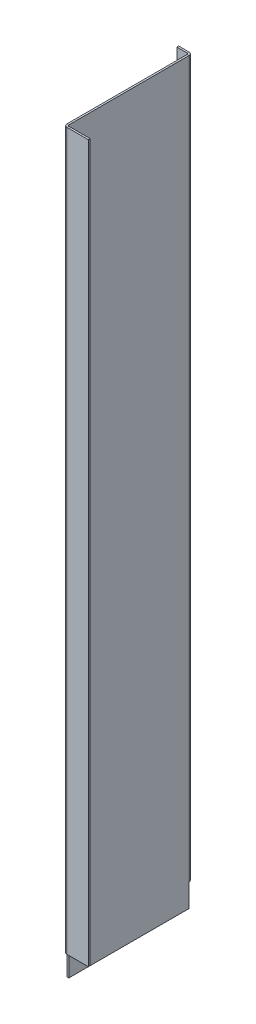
ISO-10303-21;
HEADER;
FILE_DESCRIPTION(('STEP AP214'),'2;1');
FILE_NAME('part.step','',(''),(''),'','','');
FILE_SCHEMA(('AUTOMOTIVE_DESIGN { 1 0 10303 214 1 1 1 1 }'));
ENDSEC;
DATA;
#1=APPLICATION_CONTEXT('core data for automotive mechanical design processes');
#2=APPLICATION_PROTOCOL_DEFINITION('international standard','automotive_design',2000,#1);
#3=PRODUCT_CONTEXT('',#1,'mechanical');
#4=PRODUCT('Part','Part','',(#3));
#5=PRODUCT_RELATED_PRODUCT_CATEGORY('part','',(#4));
#6=PRODUCT_DEFINITION_FORMATION('','',#4);
#7=PRODUCT_DEFINITION_CONTEXT('part definition',#1,'design');
#8=PRODUCT_DEFINITION('design','',#6,#7);
#9=PRODUCT_DEFINITION_SHAPE('','',#8);
#10=(LENGTH_UNIT() NAMED_UNIT(*) SI_UNIT(.MILLI.,.METRE.));
#11=(NAMED_UNIT(*) PLANE_ANGLE_UNIT() SI_UNIT($,.RADIAN.));
#12=(NAMED_UNIT(*) SI_UNIT($,.STERADIAN.) SOLID_ANGLE_UNIT());
#13=UNCERTAINTY_MEASURE_WITH_UNIT(LENGTH_MEASURE(1.E-05),#10,'distance_accuracy_value','');
#14=(GEOMETRIC_REPRESENTATION_CONTEXT(3) GLOBAL_UNCERTAINTY_ASSIGNED_CONTEXT((#13)) GLOBAL_UNIT_ASSIGNED_CONTEXT((#10,
#11,#12)) REPRESENTATION_CONTEXT('',''));
#15=CARTESIAN_POINT('',(0.,0.,0.));
#16=DIRECTION('',(0.,0.,1.));
#17=DIRECTION('',(1.,0.,0.));
#18=AXIS2_PLACEMENT_3D('',#15,#16,#17);
#19=CARTESIAN_POINT('',(-439.4,-313.8,1.5));
#20=DIRECTION('',(0.,1.,0.));
#21=DIRECTION('',(0.,0.,1.));
#22=AXIS2_PLACEMENT_3D('',#19,#20,#21);
#23=PLANE('',#22);
#24=DIRECTION('',(0.,0.,-1.));
#25=VECTOR('',#24,1.);
#26=CARTESIAN_POINT('',(-430.9,-313.8,1.5));
#27=LINE('',#26,#25);
#28=CARTESIAN_POINT('',(-430.9,-313.8,1.5));
#29=VERTEX_POINT('',#28);
#30=CARTESIAN_POINT('',(-430.9,-313.8,0.));
#31=VERTEX_POINT('',#30);
#32=EDGE_CURVE('E290',#29,#31,#27,.T.);
#33=ORIENTED_EDGE('',*,*,#32,.F.);
#34=DIRECTION('',(1.,0.,0.));
#35=VECTOR('',#34,1.);
#36=CARTESIAN_POINT('',(-439.4,-313.8,1.5));
#37=LINE('',#36,#35);
#38=CARTESIAN_POINT('',(-439.4,-313.8,1.5));
#39=VERTEX_POINT('',#38);
#40=EDGE_CURVE('E301',#39,#29,#37,.T.);
#41=ORIENTED_EDGE('',*,*,#40,.F.);
#42=DIRECTION('',(0.,0.,-1.));
#43=VECTOR('',#42,1.);
#44=CARTESIAN_POINT('',(-439.4,-313.8,1.5));
#45=LINE('',#44,#43);
#46=CARTESIAN_POINT('',(-439.4,-313.8,0.));
#47=VERTEX_POINT('',#46);
#48=EDGE_CURVE('E13',#39,#47,#45,.T.);
#49=ORIENTED_EDGE('',*,*,#48,.T.);
#50=DIRECTION('',(1.,0.,0.));
#51=VECTOR('',#50,1.);
#52=CARTESIAN_POINT('',(-439.4,-313.8,0.));
#53=LINE('',#52,#51);
#54=EDGE_CURVE('E309',#47,#31,#53,.T.);
#55=ORIENTED_EDGE('',*,*,#54,.T.);
#56=EDGE_LOOP('',(#33,#41,#49,#55));
#57=FACE_BOUND('',#56,.T.);
#58=ADVANCED_FACE('F78',(#57),#23,.F.);
#59=CARTESIAN_POINT('',(-439.4,272.7,1.5));
#60=DIRECTION('',(0.,-1.,0.));
#61=DIRECTION('',(1.,0.,0.));
#62=AXIS2_PLACEMENT_3D('',#59,#60,#61);
#63=PLANE('',#62);
#64=DIRECTION('',(0.,0.,-1.));
#65=VECTOR('',#64,1.);
#66=CARTESIAN_POINT('',(-430.9,272.7,1.5));
#67=LINE('',#66,#65);
#68=CARTESIAN_POINT('',(-430.9,272.7,1.5));
#69=VERTEX_POINT('',#68);
#70=CARTESIAN_POINT('',(-430.9,272.7,0.));
#71=VERTEX_POINT('',#70);
#72=EDGE_CURVE('E278',#69,#71,#67,.T.);
#73=ORIENTED_EDGE('',*,*,#72,.T.);
#74=DIRECTION('',(-1.,0.,0.));
#75=VECTOR('',#74,1.);
#76=CARTESIAN_POINT('',(-439.4,272.7,0.));
#77=LINE('',#76,#75);
#78=CARTESIAN_POINT('',(-439.4,272.7,0.));
#79=VERTEX_POINT('',#78);
#80=EDGE_CURVE('E302',#71,#79,#77,.T.);
#81=ORIENTED_EDGE('',*,*,#80,.T.);
#82=DIRECTION('',(0.,0.,-1.));
#83=VECTOR('',#82,1.);
#84=CARTESIAN_POINT('',(-439.4,272.7,1.5));
#85=LINE('',#84,#83);
#86=CARTESIAN_POINT('',(-439.4,272.7,1.5));
#87=VERTEX_POINT('',#86);
#88=EDGE_CURVE('E86',#87,#79,#85,.T.);
#89=ORIENTED_EDGE('',*,*,#88,.F.);
#90=DIRECTION('',(-1.,0.,0.));
#91=VECTOR('',#90,1.);
#92=CARTESIAN_POINT('',(-439.4,272.7,1.5));
#93=LINE('',#92,#91);
#94=EDGE_CURVE('E305',#69,#87,#93,.T.);
#95=ORIENTED_EDGE('',*,*,#94,.F.);
#96=EDGE_LOOP('',(#73,#81,#89,#95));
#97=FACE_BOUND('',#96,.T.);
#98=ADVANCED_FACE('F328',(#97),#63,.F.);
#99=CARTESIAN_POINT('',(0.,0.,1.5));
#100=DIRECTION('',(0.,0.,-1.));
#101=DIRECTION('',(-1.,0.,0.));
#102=AXIS2_PLACEMENT_3D('',#99,#100,#101);
#103=PLANE('',#102);
#104=CARTESIAN_POINT('',(-435.15,-303.8,1.5));
#105=DIRECTION('',(0.,0.,1.));
#106=DIRECTION('',(1.,0.,0.));
#107=AXIS2_PLACEMENT_3D('',#104,#105,#106);
#108=CIRCLE('',#107,1.50000000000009);
#109=CARTESIAN_POINT('',(-433.65,-303.8,1.5));
#110=VERTEX_POINT('',#109);
#111=EDGE_CURVE('E377',#110,#110,#108,.T.);
#112=ORIENTED_EDGE('',*,*,#111,.F.);
#113=EDGE_LOOP('',(#112));
#114=FACE_BOUND('',#113,.T.);
#115=CARTESIAN_POINT('',(-435.15,262.7,1.5));
#116=DIRECTION('',(0.,0.,1.));
#117=DIRECTION('',(1.,0.,0.));
#118=AXIS2_PLACEMENT_3D('',#115,#116,#117);
#119=CIRCLE('',#118,1.49999999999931);
#120=CARTESIAN_POINT('',(-433.650000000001,262.7,1.5));
#121=VERTEX_POINT('',#120);
#122=EDGE_CURVE('E371',#121,#121,#119,.T.);
#123=ORIENTED_EDGE('',*,*,#122,.F.);
#124=EDGE_LOOP('',(#123));
#125=FACE_BOUND('',#124,.T.);
#126=DIRECTION('',(0.,1.,0.));
#127=VECTOR('',#126,1.);
#128=CARTESIAN_POINT('',(-430.9,272.7,1.5));
#129=LINE('',#128,#127);
#130=EDGE_CURVE('E284',#69,#29,#129,.F.);
#131=ORIENTED_EDGE('',*,*,#130,.F.);
#132=ORIENTED_EDGE('',*,*,#94,.T.);
#133=DIRECTION('',(0.,-1.,0.));
#134=VECTOR('',#133,1.);
#135=CARTESIAN_POINT('',(-439.4,-313.8,1.5));
#136=LINE('',#135,#134);
#137=EDGE_CURVE('E298',#87,#39,#136,.T.);
#138=ORIENTED_EDGE('',*,*,#137,.T.);
#139=ORIENTED_EDGE('',*,*,#40,.T.);
#140=EDGE_LOOP('',(#131,#132,#138,#139));
#141=FACE_BOUND('',#140,.T.);
#142=ADVANCED_FACE('F327',(#114,#125,#141),#103,.F.);
#143=CARTESIAN_POINT('',(0.,0.,0.));
#144=DIRECTION('',(0.,0.,-1.));
#145=DIRECTION('',(-1.,0.,0.));
#146=AXIS2_PLACEMENT_3D('',#143,#144,#145);
#147=PLANE('',#146);
#148=CARTESIAN_POINT('',(-435.15,-303.8,0.));
#149=DIRECTION('',(0.,0.,1.));
#150=DIRECTION('',(1.,0.,0.));
#151=AXIS2_PLACEMENT_3D('',#148,#149,#150);
#152=CIRCLE('',#151,1.50000000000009);
#153=CARTESIAN_POINT('',(-433.65,-303.8,0.));
#154=VERTEX_POINT('',#153);
#155=EDGE_CURVE('E231',#154,#154,#152,.T.);
#156=ORIENTED_EDGE('',*,*,#155,.T.);
#157=EDGE_LOOP('',(#156));
#158=FACE_BOUND('',#157,.T.);
#159=CARTESIAN_POINT('',(-435.15,262.7,0.));
#160=DIRECTION('',(0.,0.,1.));
#161=DIRECTION('',(1.,0.,0.));
#162=AXIS2_PLACEMENT_3D('',#159,#160,#161);
#163=CIRCLE('',#162,1.49999999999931);
#164=CARTESIAN_POINT('',(-433.650000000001,262.7,0.));
#165=VERTEX_POINT('',#164);
#166=EDGE_CURVE('E374',#165,#165,#163,.T.);
#167=ORIENTED_EDGE('',*,*,#166,.T.);
#168=EDGE_LOOP('',(#167));
#169=FACE_BOUND('',#168,.T.);
#170=ORIENTED_EDGE('',*,*,#80,.F.);
#171=DIRECTION('',(0.,1.,0.));
#172=VECTOR('',#171,1.);
#173=CARTESIAN_POINT('',(-430.9,272.7,0.));
#174=LINE('',#173,#172);
#175=EDGE_CURVE('E273',#71,#31,#174,.F.);
#176=ORIENTED_EDGE('',*,*,#175,.T.);
#177=ORIENTED_EDGE('',*,*,#54,.F.);
#178=DIRECTION('',(0.,-1.,0.));
#179=VECTOR('',#178,1.);
#180=CARTESIAN_POINT('',(-439.4,-313.8,0.));
#181=LINE('',#180,#179);
#182=EDGE_CURVE('E295',#79,#47,#181,.T.);
#183=ORIENTED_EDGE('',*,*,#182,.F.);
#184=EDGE_LOOP('',(#170,#176,#177,#183));
#185=FACE_BOUND('',#184,.T.);
#186=ADVANCED_FACE('F322',(#158,#169,#185),#147,.T.);
#187=CARTESIAN_POINT('',(-439.4,-313.8,1.5));
#188=DIRECTION('',(1.,0.,0.));
#189=DIRECTION('',(0.,0.,-1.));
#190=AXIS2_PLACEMENT_3D('',#187,#188,#189);
#191=PLANE('',#190);
#192=ORIENTED_EDGE('',*,*,#182,.T.);
#193=ORIENTED_EDGE('',*,*,#48,.F.);
#194=ORIENTED_EDGE('',*,*,#137,.F.);
#195=ORIENTED_EDGE('',*,*,#88,.T.);
#196=EDGE_LOOP('',(#192,#193,#194,#195));
#197=FACE_BOUND('',#196,.T.);
#198=ADVANCED_FACE('F80',(#197),#191,.F.);
#199=CARTESIAN_POINT('',(-430.9,-313.8,2.50000000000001));
#200=DIRECTION('',(0.,-1.,0.));
#201=DIRECTION('',(0.,0.,-1.));
#202=AXIS2_PLACEMENT_3D('',#199,#200,#201);
#203=PLANE('',#202);
#204=DIRECTION('',(1.,0.,0.));
#205=VECTOR('',#204,1.);
#206=CARTESIAN_POINT('',(-429.9,-313.8,2.5));
#207=LINE('',#206,#205);
#208=CARTESIAN_POINT('',(-429.9,-313.8,2.5));
#209=VERTEX_POINT('',#208);
#210=CARTESIAN_POINT('',(-428.4,-313.8,2.5));
#211=VERTEX_POINT('',#210);
#212=EDGE_CURVE('E292',#209,#211,#207,.T.);
#213=ORIENTED_EDGE('',*,*,#212,.F.);
#214=CARTESIAN_POINT('',(-430.9,-313.8,2.50000000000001));
#215=DIRECTION('',(0.,1.,0.));
#216=DIRECTION('',(0.,0.,1.));
#217=AXIS2_PLACEMENT_3D('',#214,#215,#216);
#218=CIRCLE('',#217,1.);
#219=EDGE_CURVE('E281',#29,#209,#218,.F.);
#220=ORIENTED_EDGE('',*,*,#219,.F.);
#221=ORIENTED_EDGE('',*,*,#32,.T.);
#222=CARTESIAN_POINT('',(-430.9,-313.8,2.50000000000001));
#223=DIRECTION('',(0.,1.,0.));
#224=DIRECTION('',(0.,0.,1.));
#225=AXIS2_PLACEMENT_3D('',#222,#223,#224);
#226=CIRCLE('',#225,2.5);
#227=EDGE_CURVE('E101',#31,#211,#226,.F.);
#228=ORIENTED_EDGE('',*,*,#227,.T.);
#229=EDGE_LOOP('',(#213,#220,#221,#228));
#230=FACE_BOUND('',#229,.T.);
#231=ADVANCED_FACE('F417',(#230),#203,.T.);
#232=CARTESIAN_POINT('',(-430.9,272.7,2.50000000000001));
#233=DIRECTION('',(0.,-1.,0.));
#234=DIRECTION('',(0.,0.,-1.));
#235=AXIS2_PLACEMENT_3D('',#232,#233,#234);
#236=PLANE('',#235);
#237=CARTESIAN_POINT('',(-430.9,272.7,2.50000000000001));
#238=DIRECTION('',(0.,1.,0.));
#239=DIRECTION('',(0.,0.,1.));
#240=AXIS2_PLACEMENT_3D('',#237,#238,#239);
#241=CIRCLE('',#240,1.);
#242=CARTESIAN_POINT('',(-429.9,272.7,2.5));
#243=VERTEX_POINT('',#242);
#244=EDGE_CURVE('E286',#243,#69,#241,.T.);
#245=ORIENTED_EDGE('',*,*,#244,.F.);
#246=DIRECTION('',(-1.,0.,0.));
#247=VECTOR('',#246,1.);
#248=CARTESIAN_POINT('',(-429.9,272.7,2.5));
#249=LINE('',#248,#247);
#250=CARTESIAN_POINT('',(-428.4,272.7,2.5));
#251=VERTEX_POINT('',#250);
#252=EDGE_CURVE('E266',#243,#251,#249,.F.);
#253=ORIENTED_EDGE('',*,*,#252,.T.);
#254=CARTESIAN_POINT('',(-430.9,272.7,2.50000000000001));
#255=DIRECTION('',(0.,1.,0.));
#256=DIRECTION('',(0.,0.,1.));
#257=AXIS2_PLACEMENT_3D('',#254,#255,#256);
#258=CIRCLE('',#257,2.5);
#259=EDGE_CURVE('E276',#251,#71,#258,.T.);
#260=ORIENTED_EDGE('',*,*,#259,.T.);
#261=ORIENTED_EDGE('',*,*,#72,.F.);
#262=EDGE_LOOP('',(#245,#253,#260,#261));
#263=FACE_BOUND('',#262,.T.);
#264=ADVANCED_FACE('F331',(#263),#236,.F.);
#265=CARTESIAN_POINT('',(-430.9,272.7,2.50000000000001));
#266=DIRECTION('',(0.,1.,0.));
#267=DIRECTION('',(1.,0.,0.));
#268=AXIS2_PLACEMENT_3D('',#265,#266,#267);
#269=CYLINDRICAL_SURFACE('',#268,2.5);
#270=ORIENTED_EDGE('',*,*,#175,.F.);
#271=ORIENTED_EDGE('',*,*,#259,.F.);
#272=DIRECTION('',(0.,1.,0.));
#273=VECTOR('',#272,1.);
#274=CARTESIAN_POINT('',(-428.4,-332.8,2.5));
#275=LINE('',#274,#273);
#276=EDGE_CURVE('E263',#251,#211,#275,.F.);
#277=ORIENTED_EDGE('',*,*,#276,.T.);
#278=ORIENTED_EDGE('',*,*,#227,.F.);
#279=EDGE_LOOP('',(#270,#271,#277,#278));
#280=FACE_BOUND('',#279,.T.);
#281=ADVANCED_FACE('F416',(#280),#269,.T.);
#282=CARTESIAN_POINT('',(-430.9,272.7,2.50000000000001));
#283=DIRECTION('',(0.,1.,0.));
#284=DIRECTION('',(1.,0.,0.));
#285=AXIS2_PLACEMENT_3D('',#282,#283,#284);
#286=CYLINDRICAL_SURFACE('',#285,1.);
#287=ORIENTED_EDGE('',*,*,#130,.T.);
#288=ORIENTED_EDGE('',*,*,#219,.T.);
#289=DIRECTION('',(0.,1.,0.));
#290=VECTOR('',#289,1.);
#291=CARTESIAN_POINT('',(-429.9,272.7,2.5));
#292=LINE('',#291,#290);
#293=EDGE_CURVE('E241',#209,#243,#292,.T.);
#294=ORIENTED_EDGE('',*,*,#293,.T.);
#295=ORIENTED_EDGE('',*,*,#244,.T.);
#296=EDGE_LOOP('',(#287,#288,#294,#295));
#297=FACE_BOUND('',#296,.T.);
#298=ADVANCED_FACE('F335',(#297),#286,.F.);
#299=CARTESIAN_POINT('',(-428.4,272.7,101.));
#300=DIRECTION('',(0.,-1.,0.));
#301=DIRECTION('',(0.,0.,-1.));
#302=AXIS2_PLACEMENT_3D('',#299,#300,#301);
#303=PLANE('',#302);
#304=ORIENTED_EDGE('',*,*,#252,.F.);
#305=DIRECTION('',(0.,0.,-1.));
#306=VECTOR('',#305,1.);
#307=CARTESIAN_POINT('',(-429.9,272.7,101.));
#308=LINE('',#307,#306);
#309=CARTESIAN_POINT('',(-429.9,272.7,101.));
#310=VERTEX_POINT('',#309);
#311=EDGE_CURVE('E260',#243,#310,#308,.F.);
#312=ORIENTED_EDGE('',*,*,#311,.T.);
#313=DIRECTION('',(-1.,0.,0.));
#314=VECTOR('',#313,1.);
#315=CARTESIAN_POINT('',(-428.4,272.7,101.));
#316=LINE('',#315,#314);
#317=CARTESIAN_POINT('',(-428.4,272.7,101.));
#318=VERTEX_POINT('',#317);
#319=EDGE_CURVE('E239',#318,#310,#316,.T.);
#320=ORIENTED_EDGE('',*,*,#319,.F.);
#321=DIRECTION('',(0.,0.,1.));
#322=VECTOR('',#321,1.);
#323=CARTESIAN_POINT('',(-428.4,272.7,1.58093116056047E-12));
#324=LINE('',#323,#322);
#325=EDGE_CURVE('E252',#251,#318,#324,.T.);
#326=ORIENTED_EDGE('',*,*,#325,.F.);
#327=EDGE_LOOP('',(#304,#312,#320,#326));
#328=FACE_BOUND('',#327,.T.);
#329=ADVANCED_FACE('F423',(#328),#303,.F.);
#330=CARTESIAN_POINT('',(-428.4,-332.8,1.49999999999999));
#331=DIRECTION('',(0.,1.,0.));
#332=DIRECTION('',(0.,0.,1.));
#333=AXIS2_PLACEMENT_3D('',#330,#331,#332);
#334=PLANE('',#333);
#335=DIRECTION('',(-1.,0.,0.));
#336=VECTOR('',#335,1.);
#337=CARTESIAN_POINT('',(-428.4,-332.8,2.5));
#338=LINE('',#337,#336);
#339=CARTESIAN_POINT('',(-429.9,-332.8,2.5));
#340=VERTEX_POINT('',#339);
#341=CARTESIAN_POINT('',(-428.4,-332.8,2.5));
#342=VERTEX_POINT('',#341);
#343=EDGE_CURVE('E238',#340,#342,#338,.F.);
#344=ORIENTED_EDGE('',*,*,#343,.T.);
#345=DIRECTION('',(0.,0.,-1.));
#346=VECTOR('',#345,1.);
#347=CARTESIAN_POINT('',(-428.4,-332.8,1.42879155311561E-12));
#348=LINE('',#347,#346);
#349=CARTESIAN_POINT('',(-428.4,-332.8,101.));
#350=VERTEX_POINT('',#349);
#351=EDGE_CURVE('E245',#350,#342,#348,.T.);
#352=ORIENTED_EDGE('',*,*,#351,.F.);
#353=DIRECTION('',(-1.,0.,0.));
#354=VECTOR('',#353,1.);
#355=CARTESIAN_POINT('',(-428.4,-332.8,101.));
#356=LINE('',#355,#354);
#357=CARTESIAN_POINT('',(-429.9,-332.8,101.));
#358=VERTEX_POINT('',#357);
#359=EDGE_CURVE('E242',#350,#358,#356,.T.);
#360=ORIENTED_EDGE('',*,*,#359,.T.);
#361=DIRECTION('',(0.,0.,1.));
#362=VECTOR('',#361,1.);
#363=CARTESIAN_POINT('',(-429.9,-332.8,1.5));
#364=LINE('',#363,#362);
#365=EDGE_CURVE('E255',#358,#340,#364,.F.);
#366=ORIENTED_EDGE('',*,*,#365,.T.);
#367=EDGE_LOOP('',(#344,#352,#360,#366));
#368=FACE_BOUND('',#367,.T.);
#369=ADVANCED_FACE('F348',(#368),#334,.F.);
#370=CARTESIAN_POINT('',(-428.4,0.,1.42879155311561E-12));
#371=DIRECTION('',(-1.,0.,0.));
#372=DIRECTION('',(0.,0.,1.));
#373=AXIS2_PLACEMENT_3D('',#370,#371,#372);
#374=PLANE('',#373);
#375=ORIENTED_EDGE('',*,*,#276,.F.);
#376=ORIENTED_EDGE('',*,*,#325,.T.);
#377=DIRECTION('',(0.,-1.,0.));
#378=VECTOR('',#377,1.);
#379=CARTESIAN_POINT('',(-428.4,0.,101.));
#380=LINE('',#379,#378);
#381=CARTESIAN_POINT('',(-428.4,-314.3,101.));
#382=VERTEX_POINT('',#381);
#383=EDGE_CURVE('E248',#318,#382,#380,.T.);
#384=ORIENTED_EDGE('',*,*,#383,.T.);
#385=EDGE_CURVE('E251',#382,#350,#380,.T.);
#386=ORIENTED_EDGE('',*,*,#385,.T.);
#387=ORIENTED_EDGE('',*,*,#351,.T.);
#388=EDGE_CURVE('E265',#211,#342,#275,.F.);
#389=ORIENTED_EDGE('',*,*,#388,.F.);
#390=EDGE_LOOP('',(#375,#376,#384,#386,#387,#389));
#391=FACE_BOUND('',#390,.T.);
#392=ADVANCED_FACE('F351',(#391),#374,.F.);
#393=CARTESIAN_POINT('',(-429.9,0.,1.43402877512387E-12));
#394=DIRECTION('',(-1.,0.,0.));
#395=DIRECTION('',(0.,0.,1.));
#396=AXIS2_PLACEMENT_3D('',#393,#394,#395);
#397=PLANE('',#396);
#398=ORIENTED_EDGE('',*,*,#311,.F.);
#399=ORIENTED_EDGE('',*,*,#293,.F.);
#400=DIRECTION('',(0.,1.,0.));
#401=VECTOR('',#400,1.);
#402=CARTESIAN_POINT('',(-429.9,-332.8,2.5));
#403=LINE('',#402,#401);
#404=EDGE_CURVE('E268',#340,#209,#403,.T.);
#405=ORIENTED_EDGE('',*,*,#404,.F.);
#406=ORIENTED_EDGE('',*,*,#365,.F.);
#407=DIRECTION('',(0.,1.,0.));
#408=VECTOR('',#407,1.);
#409=CARTESIAN_POINT('',(-429.9,-332.8,101.));
#410=LINE('',#409,#408);
#411=CARTESIAN_POINT('',(-429.9,-314.3,101.));
#412=VERTEX_POINT('',#411);
#413=EDGE_CURVE('E259',#412,#358,#410,.F.);
#414=ORIENTED_EDGE('',*,*,#413,.F.);
#415=EDGE_CURVE('E183',#310,#412,#410,.F.);
#416=ORIENTED_EDGE('',*,*,#415,.F.);
#417=EDGE_LOOP('',(#398,#399,#405,#406,#414,#416));
#418=FACE_BOUND('',#417,.T.);
#419=ADVANCED_FACE('F341',(#418),#397,.T.);
#420=CARTESIAN_POINT('',(-428.4,-332.8,101.));
#421=DIRECTION('',(0.,0.,-1.));
#422=DIRECTION('',(-1.,0.,0.));
#423=AXIS2_PLACEMENT_3D('',#420,#421,#422);
#424=PLANE('',#423);
#425=ORIENTED_EDGE('',*,*,#385,.F.);
#426=DIRECTION('',(-1.,0.,0.));
#427=VECTOR('',#426,1.);
#428=CARTESIAN_POINT('',(-428.4,-314.3,101.));
#429=LINE('',#428,#427);
#430=EDGE_CURVE('E232',#382,#412,#429,.T.);
#431=ORIENTED_EDGE('',*,*,#430,.T.);
#432=ORIENTED_EDGE('',*,*,#413,.T.);
#433=ORIENTED_EDGE('',*,*,#359,.F.);
#434=EDGE_LOOP('',(#425,#431,#432,#433));
#435=FACE_BOUND('',#434,.T.);
#436=ADVANCED_FACE('F355',(#435),#424,.F.);
#437=CARTESIAN_POINT('',(-429.9,-332.8,2.5));
#438=DIRECTION('',(0.,0.,-1.));
#439=DIRECTION('',(-1.,0.,0.));
#440=AXIS2_PLACEMENT_3D('',#437,#438,#439);
#441=PLANE('',#440);
#442=ORIENTED_EDGE('',*,*,#404,.T.);
#443=ORIENTED_EDGE('',*,*,#212,.T.);
#444=ORIENTED_EDGE('',*,*,#388,.T.);
#445=ORIENTED_EDGE('',*,*,#343,.F.);
#446=EDGE_LOOP('',(#442,#443,#444,#445));
#447=FACE_BOUND('',#446,.T.);
#448=ADVANCED_FACE('F344',(#447),#441,.T.);
#449=CARTESIAN_POINT('',(-427.4,272.7,101.));
#450=DIRECTION('',(0.,1.,0.));
#451=DIRECTION('',(0.,0.,1.));
#452=AXIS2_PLACEMENT_3D('',#449,#450,#451);
#453=PLANE('',#452);
#454=DIRECTION('',(0.,0.,1.));
#455=VECTOR('',#454,1.);
#456=CARTESIAN_POINT('',(-427.4,272.7,103.5));
#457=LINE('',#456,#455);
#458=CARTESIAN_POINT('',(-427.4,272.7,102.));
#459=VERTEX_POINT('',#458);
#460=CARTESIAN_POINT('',(-427.4,272.7,103.5));
#461=VERTEX_POINT('',#460);
#462=EDGE_CURVE('E228',#459,#461,#457,.T.);
#463=ORIENTED_EDGE('',*,*,#462,.F.);
#464=CARTESIAN_POINT('',(-427.4,272.7,101.));
#465=DIRECTION('',(0.,-1.,0.));
#466=DIRECTION('',(0.,0.,-1.));
#467=AXIS2_PLACEMENT_3D('',#464,#465,#466);
#468=CIRCLE('',#467,1.);
#469=EDGE_CURVE('E186',#318,#459,#468,.F.);
#470=ORIENTED_EDGE('',*,*,#469,.F.);
#471=ORIENTED_EDGE('',*,*,#319,.T.);
#472=CARTESIAN_POINT('',(-427.4,272.7,101.));
#473=DIRECTION('',(0.,-1.,0.));
#474=DIRECTION('',(0.,0.,-1.));
#475=AXIS2_PLACEMENT_3D('',#472,#473,#474);
#476=CIRCLE('',#475,2.5);
#477=EDGE_CURVE('E185',#310,#461,#476,.F.);
#478=ORIENTED_EDGE('',*,*,#477,.T.);
#479=EDGE_LOOP('',(#463,#470,#471,#478));
#480=FACE_BOUND('',#479,.T.);
#481=ADVANCED_FACE('F439',(#480),#453,.T.);
#482=CARTESIAN_POINT('',(-427.4,-314.3,101.));
#483=DIRECTION('',(0.,1.,0.));
#484=DIRECTION('',(0.,0.,1.));
#485=AXIS2_PLACEMENT_3D('',#482,#483,#484);
#486=PLANE('',#485);
#487=CARTESIAN_POINT('',(-427.4,-314.3,101.));
#488=DIRECTION('',(0.,-1.,0.));
#489=DIRECTION('',(0.,0.,-1.));
#490=AXIS2_PLACEMENT_3D('',#487,#488,#489);
#491=CIRCLE('',#490,1.);
#492=CARTESIAN_POINT('',(-427.4,-314.3,102.));
#493=VERTEX_POINT('',#492);
#494=EDGE_CURVE('E193',#493,#382,#491,.T.);
#495=ORIENTED_EDGE('',*,*,#494,.F.);
#496=DIRECTION('',(0.,0.,1.));
#497=VECTOR('',#496,1.);
#498=CARTESIAN_POINT('',(-427.4,-314.3,102.));
#499=LINE('',#498,#497);
#500=CARTESIAN_POINT('',(-427.4,-314.3,103.5));
#501=VERTEX_POINT('',#500);
#502=EDGE_CURVE('E190',#493,#501,#499,.T.);
#503=ORIENTED_EDGE('',*,*,#502,.T.);
#504=CARTESIAN_POINT('',(-427.4,-314.3,101.));
#505=DIRECTION('',(0.,-1.,0.));
#506=DIRECTION('',(0.,0.,-1.));
#507=AXIS2_PLACEMENT_3D('',#504,#505,#506);
#508=CIRCLE('',#507,2.5);
#509=EDGE_CURVE('E93',#501,#412,#508,.T.);
#510=ORIENTED_EDGE('',*,*,#509,.T.);
#511=ORIENTED_EDGE('',*,*,#430,.F.);
#512=EDGE_LOOP('',(#495,#503,#510,#511));
#513=FACE_BOUND('',#512,.T.);
#514=ADVANCED_FACE('F191',(#513),#486,.F.);
#515=CARTESIAN_POINT('',(-427.4,-314.3,101.));
#516=DIRECTION('',(0.,-1.,0.));
#517=DIRECTION('',(0.,0.,1.));
#518=AXIS2_PLACEMENT_3D('',#515,#516,#517);
#519=CYLINDRICAL_SURFACE('',#518,2.5);
#520=ORIENTED_EDGE('',*,*,#415,.T.);
#521=ORIENTED_EDGE('',*,*,#509,.F.);
#522=DIRECTION('',(0.,-1.,0.));
#523=VECTOR('',#522,1.);
#524=CARTESIAN_POINT('',(-427.4,0.,103.5));
#525=LINE('',#524,#523);
#526=EDGE_CURVE('E180',#461,#501,#525,.T.);
#527=ORIENTED_EDGE('',*,*,#526,.F.);
#528=ORIENTED_EDGE('',*,*,#477,.F.);
#529=EDGE_LOOP('',(#520,#521,#527,#528));
#530=FACE_BOUND('',#529,.T.);
#531=ADVANCED_FACE('F177',(#530),#519,.T.);
#532=CARTESIAN_POINT('',(-427.4,-314.3,101.));
#533=DIRECTION('',(0.,-1.,0.));
#534=DIRECTION('',(0.,0.,1.));
#535=AXIS2_PLACEMENT_3D('',#532,#533,#534);
#536=CYLINDRICAL_SURFACE('',#535,1.);
#537=ORIENTED_EDGE('',*,*,#383,.F.);
#538=ORIENTED_EDGE('',*,*,#469,.T.);
#539=DIRECTION('',(0.,1.,0.));
#540=VECTOR('',#539,1.);
#541=CARTESIAN_POINT('',(-427.4,272.7,102.));
#542=LINE('',#541,#540);
#543=EDGE_CURVE('E198',#459,#493,#542,.F.);
#544=ORIENTED_EDGE('',*,*,#543,.T.);
#545=ORIENTED_EDGE('',*,*,#494,.T.);
#546=EDGE_LOOP('',(#537,#538,#544,#545));
#547=FACE_BOUND('',#546,.T.);
#548=ADVANCED_FACE('F358',(#547),#536,.F.);
#549=CARTESIAN_POINT('',(-428.4,-314.3,103.5));
#550=DIRECTION('',(0.,-1.,0.));
#551=DIRECTION('',(0.,0.,-1.));
#552=AXIS2_PLACEMENT_3D('',#549,#550,#551);
#553=PLANE('',#552);
#554=DIRECTION('',(-1.,0.,0.));
#555=VECTOR('',#554,1.);
#556=CARTESIAN_POINT('',(-428.4,-314.3,103.5));
#557=LINE('',#556,#555);
#558=CARTESIAN_POINT('',(-409.9,-314.3,103.5));
#559=VERTEX_POINT('',#558);
#560=EDGE_CURVE('E205',#559,#501,#557,.T.);
#561=ORIENTED_EDGE('',*,*,#560,.T.);
#562=ORIENTED_EDGE('',*,*,#502,.F.);
#563=DIRECTION('',(1.,0.,0.));
#564=VECTOR('',#563,1.);
#565=CARTESIAN_POINT('',(0.,-314.3,102.));
#566=LINE('',#565,#564);
#567=CARTESIAN_POINT('',(-409.9,-314.3,102.));
#568=VERTEX_POINT('',#567);
#569=EDGE_CURVE('E221',#568,#493,#566,.F.);
#570=ORIENTED_EDGE('',*,*,#569,.F.);
#571=DIRECTION('',(0.,0.,-1.));
#572=VECTOR('',#571,1.);
#573=CARTESIAN_POINT('',(-409.9,-314.3,103.5));
#574=LINE('',#573,#572);
#575=EDGE_CURVE('E210',#559,#568,#574,.T.);
#576=ORIENTED_EDGE('',*,*,#575,.F.);
#577=EDGE_LOOP('',(#561,#562,#570,#576));
#578=FACE_BOUND('',#577,.T.);
#579=ADVANCED_FACE('F209',(#578),#553,.T.);
#580=CARTESIAN_POINT('',(-409.9,272.7,103.5));
#581=DIRECTION('',(0.,1.,0.));
#582=DIRECTION('',(-1.,0.,0.));
#583=AXIS2_PLACEMENT_3D('',#580,#581,#582);
#584=PLANE('',#583);
#585=DIRECTION('',(-1.,0.,0.));
#586=VECTOR('',#585,1.);
#587=CARTESIAN_POINT('',(-1.63318134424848E-12,272.700000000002,102.));
#588=LINE('',#587,#586);
#589=CARTESIAN_POINT('',(-409.9,272.7,102.));
#590=VERTEX_POINT('',#589);
#591=EDGE_CURVE('E207',#459,#590,#588,.F.);
#592=ORIENTED_EDGE('',*,*,#591,.F.);
#593=ORIENTED_EDGE('',*,*,#462,.T.);
#594=DIRECTION('',(1.,0.,0.));
#595=VECTOR('',#594,1.);
#596=CARTESIAN_POINT('',(-409.9,272.7,103.5));
#597=LINE('',#596,#595);
#598=CARTESIAN_POINT('',(-409.9,272.7,103.5));
#599=VERTEX_POINT('',#598);
#600=EDGE_CURVE('E206',#461,#599,#597,.T.);
#601=ORIENTED_EDGE('',*,*,#600,.T.);
#602=DIRECTION('',(0.,0.,-1.));
#603=VECTOR('',#602,1.);
#604=CARTESIAN_POINT('',(-409.9,272.7,103.5));
#605=LINE('',#604,#603);
#606=EDGE_CURVE('E212',#599,#590,#605,.T.);
#607=ORIENTED_EDGE('',*,*,#606,.T.);
#608=EDGE_LOOP('',(#592,#593,#601,#607));
#609=FACE_BOUND('',#608,.T.);
#610=ADVANCED_FACE('F365',(#609),#584,.T.);
#611=CARTESIAN_POINT('',(0.,0.,103.5));
#612=DIRECTION('',(0.,0.,1.));
#613=DIRECTION('',(1.,0.,0.));
#614=AXIS2_PLACEMENT_3D('',#611,#612,#613);
#615=PLANE('',#614);
#616=ORIENTED_EDGE('',*,*,#600,.F.);
#617=ORIENTED_EDGE('',*,*,#526,.T.);
#618=ORIENTED_EDGE('',*,*,#560,.F.);
#619=DIRECTION('',(0.,-1.,0.));
#620=VECTOR('',#619,1.);
#621=CARTESIAN_POINT('',(-409.9,-314.3,103.5));
#622=LINE('',#621,#620);
#623=EDGE_CURVE('E213',#599,#559,#622,.T.);
#624=ORIENTED_EDGE('',*,*,#623,.F.);
#625=EDGE_LOOP('',(#616,#617,#618,#624));
#626=FACE_BOUND('',#625,.T.);
#627=ADVANCED_FACE('F203',(#626),#615,.T.);
#628=CARTESIAN_POINT('',(0.,0.,102.));
#629=DIRECTION('',(0.,0.,1.));
#630=DIRECTION('',(1.,0.,0.));
#631=AXIS2_PLACEMENT_3D('',#628,#629,#630);
#632=PLANE('',#631);
#633=ORIENTED_EDGE('',*,*,#543,.F.);
#634=ORIENTED_EDGE('',*,*,#591,.T.);
#635=DIRECTION('',(0.,1.,0.));
#636=VECTOR('',#635,1.);
#637=CARTESIAN_POINT('',(-409.9,0.,102.));
#638=LINE('',#637,#636);
#639=EDGE_CURVE('E223',#590,#568,#638,.F.);
#640=ORIENTED_EDGE('',*,*,#639,.T.);
#641=ORIENTED_EDGE('',*,*,#569,.T.);
#642=EDGE_LOOP('',(#633,#634,#640,#641));
#643=FACE_BOUND('',#642,.T.);
#644=ADVANCED_FACE('F363',(#643),#632,.F.);
#645=CARTESIAN_POINT('',(-409.9,-314.3,103.5));
#646=DIRECTION('',(1.,0.,0.));
#647=DIRECTION('',(0.,0.,-1.));
#648=AXIS2_PLACEMENT_3D('',#645,#646,#647);
#649=PLANE('',#648);
#650=ORIENTED_EDGE('',*,*,#639,.F.);
#651=ORIENTED_EDGE('',*,*,#606,.F.);
#652=ORIENTED_EDGE('',*,*,#623,.T.);
#653=ORIENTED_EDGE('',*,*,#575,.T.);
#654=EDGE_LOOP('',(#650,#651,#652,#653));
#655=FACE_BOUND('',#654,.T.);
#656=ADVANCED_FACE('F369',(#655),#649,.T.);
#657=CARTESIAN_POINT('',(-435.15,262.7,0.));
#658=DIRECTION('',(0.,0.,1.));
#659=DIRECTION('',(1.,0.,0.));
#660=AXIS2_PLACEMENT_3D('',#657,#658,#659);
#661=CYLINDRICAL_SURFACE('',#660,1.49999999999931);
#662=ORIENTED_EDGE('',*,*,#166,.F.);
#663=EDGE_LOOP('',(#662));
#664=FACE_BOUND('',#663,.T.);
#665=ORIENTED_EDGE('',*,*,#122,.T.);
#666=EDGE_LOOP('',(#665));
#667=FACE_BOUND('',#666,.T.);
#668=ADVANCED_FACE('F388',(#664,#667),#661,.F.);
#669=CARTESIAN_POINT('',(-435.15,-303.8,0.));
#670=DIRECTION('',(0.,0.,1.));
#671=DIRECTION('',(1.,0.,0.));
#672=AXIS2_PLACEMENT_3D('',#669,#670,#671);
#673=CYLINDRICAL_SURFACE('',#672,1.50000000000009);
#674=ORIENTED_EDGE('',*,*,#155,.F.);
#675=EDGE_LOOP('',(#674));
#676=FACE_BOUND('',#675,.T.);
#677=ORIENTED_EDGE('',*,*,#111,.T.);
#678=EDGE_LOOP('',(#677));
#679=FACE_BOUND('',#678,.T.);
#680=ADVANCED_FACE('F385',(#676,#679),#673,.F.);
#681=CLOSED_SHELL('',(#58,#98,#142,#186,#198,#231,#264,#281,#298,#329,#369,#392,#419,#436,#448,
#481,#514,#531,#548,#579,#610,#627,#644,#656,#668,#680));
#682=MANIFOLD_SOLID_BREP('B2',#681);
#683=ADVANCED_BREP_SHAPE_REPRESENTATION('',(#18,#682),#14);
#684=SHAPE_DEFINITION_REPRESENTATION(#9,#683);
ENDSEC;
END-ISO-10303-21;
